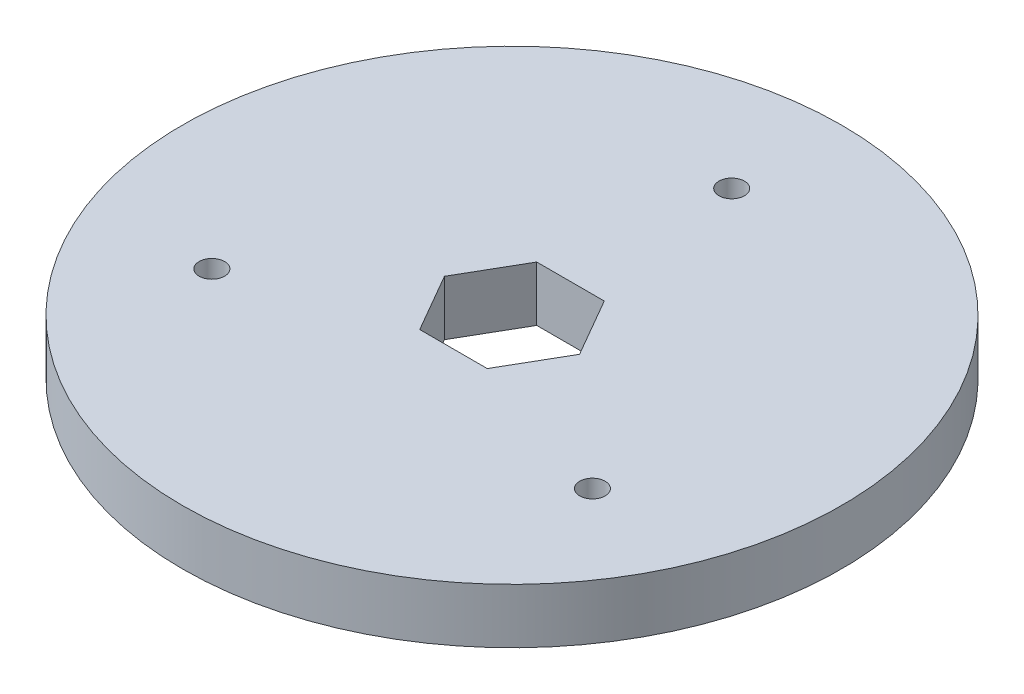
from build123d import *

# Parameters (mm, degrees)
SKETCH1_R           = 38.1
SKETCH1_R_2         = 1.4732
BOSS_EXTRUDE1_DEPTH = 6.35


with BuildPart() as part:
    # Sketch1 → Boss-Extrude1 (new body)
    with BuildSketch(Plane(origin=(0, 0, 0), x_dir=(1, 0, 0), z_dir=(0, 1, 0))):
        with Locations(Location((0, 0, 0), (0, 0, 270))):
            Circle(SKETCH1_R)
        with Locations(Location((0, 25.4, 0), (0, 0, 270))):
            Circle(SKETCH1_R_2, mode=Mode.SUBTRACT)
        with Locations(Location((21.997045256, -12.7, 0), (0, 0, 270))):
            Circle(SKETCH1_R_2, mode=Mode.SUBTRACT)
        with Locations(Location((-21.997045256, -12.7, 0), (0, 0, 270))):
            Circle(SKETCH1_R_2, mode=Mode.SUBTRACT)
        Polygon((7.808951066, 0), (3.904475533, 6.76275), (-3.904475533, 6.76275), (-7.808951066, 0), (-3.904475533, -6.76275), (3.904475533, -6.76275), align=None, mode=Mode.SUBTRACT)
    extrude(amount=BOSS_EXTRUDE1_DEPTH)


solid = part.part
